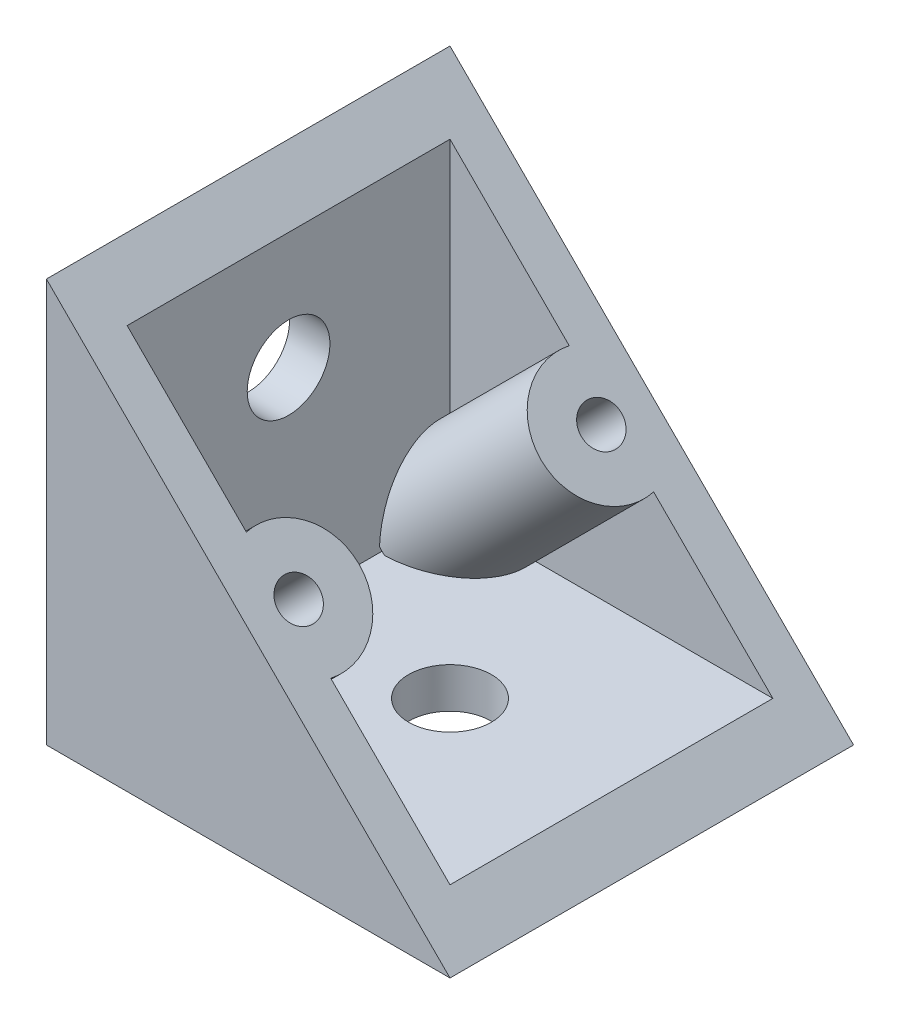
ISO-10303-21;
HEADER;
FILE_DESCRIPTION(('STEP AP214'),'2;1');
FILE_NAME('part.step','',(''),(''),'','','');
FILE_SCHEMA(('AUTOMOTIVE_DESIGN { 1 0 10303 214 1 1 1 1 }'));
ENDSEC;
DATA;
#1=APPLICATION_CONTEXT('core data for automotive mechanical design processes');
#2=APPLICATION_PROTOCOL_DEFINITION('international standard','automotive_design',2000,#1);
#3=PRODUCT_CONTEXT('',#1,'mechanical');
#4=PRODUCT('Part','Part','',(#3));
#5=PRODUCT_RELATED_PRODUCT_CATEGORY('part','',(#4));
#6=PRODUCT_DEFINITION_FORMATION('','',#4);
#7=PRODUCT_DEFINITION_CONTEXT('part definition',#1,'design');
#8=PRODUCT_DEFINITION('design','',#6,#7);
#9=PRODUCT_DEFINITION_SHAPE('','',#8);
#10=(LENGTH_UNIT() NAMED_UNIT(*) SI_UNIT(.MILLI.,.METRE.));
#11=(NAMED_UNIT(*) PLANE_ANGLE_UNIT() SI_UNIT($,.RADIAN.));
#12=(NAMED_UNIT(*) SI_UNIT($,.STERADIAN.) SOLID_ANGLE_UNIT());
#13=UNCERTAINTY_MEASURE_WITH_UNIT(LENGTH_MEASURE(1.E-05),#10,'distance_accuracy_value','');
#14=(GEOMETRIC_REPRESENTATION_CONTEXT(3) GLOBAL_UNCERTAINTY_ASSIGNED_CONTEXT((#13)) GLOBAL_UNIT_ASSIGNED_CONTEXT((#10,
#11,#12)) REPRESENTATION_CONTEXT('',''));
#15=CARTESIAN_POINT('',(0.,0.,0.));
#16=DIRECTION('',(0.,0.,1.));
#17=DIRECTION('',(1.,0.,0.));
#18=AXIS2_PLACEMENT_3D('',#15,#16,#17);
#19=CARTESIAN_POINT('',(0.,0.,40.));
#20=DIRECTION('',(0.,1.,0.));
#21=DIRECTION('',(0.,0.,1.));
#22=AXIS2_PLACEMENT_3D('',#19,#20,#21);
#23=PLANE('',#22);
#24=DIRECTION('',(-1.,0.,0.));
#25=VECTOR('',#24,1.);
#26=CARTESIAN_POINT('',(11.,0.,24.));
#27=LINE('',#26,#25);
#28=CARTESIAN_POINT('',(11.,0.,24.));
#29=VERTEX_POINT('',#28);
#30=CARTESIAN_POINT('',(9.,0.,24.));
#31=VERTEX_POINT('',#30);
#32=EDGE_CURVE('E244',#29,#31,#27,.T.);
#33=ORIENTED_EDGE('',*,*,#32,.F.);
#34=DIRECTION('',(0.,0.,1.));
#35=VECTOR('',#34,1.);
#36=CARTESIAN_POINT('',(11.,0.,16.));
#37=LINE('',#36,#35);
#38=CARTESIAN_POINT('',(11.,0.,16.));
#39=VERTEX_POINT('',#38);
#40=EDGE_CURVE('E257',#39,#29,#37,.T.);
#41=ORIENTED_EDGE('',*,*,#40,.F.);
#42=DIRECTION('',(1.,0.,0.));
#43=VECTOR('',#42,1.);
#44=CARTESIAN_POINT('',(9.,0.,16.));
#45=LINE('',#44,#43);
#46=CARTESIAN_POINT('',(9.,0.,16.));
#47=VERTEX_POINT('',#46);
#48=EDGE_CURVE('E266',#47,#39,#45,.T.);
#49=ORIENTED_EDGE('',*,*,#48,.F.);
#50=DIRECTION('',(0.,0.,-1.));
#51=VECTOR('',#50,1.);
#52=CARTESIAN_POINT('',(9.,0.,24.));
#53=LINE('',#52,#51);
#54=EDGE_CURVE('E247',#31,#47,#53,.T.);
#55=ORIENTED_EDGE('',*,*,#54,.F.);
#56=EDGE_LOOP('',(#33,#41,#49,#55));
#57=FACE_BOUND('',#56,.T.);
#58=CARTESIAN_POINT('',(20.,0.,20.));
#59=DIRECTION('',(0.,-1.,0.));
#60=DIRECTION('',(0.,0.,-1.));
#61=AXIS2_PLACEMENT_3D('',#58,#59,#60);
#62=CIRCLE('',#61,4.1);
#63=CARTESIAN_POINT('',(20.,0.,15.9));
#64=VERTEX_POINT('',#63);
#65=EDGE_CURVE('E348',#64,#64,#62,.T.);
#66=ORIENTED_EDGE('',*,*,#65,.F.);
#67=EDGE_LOOP('',(#66));
#68=FACE_BOUND('',#67,.T.);
#69=DIRECTION('',(1.,0.,0.));
#70=VECTOR('',#69,1.);
#71=CARTESIAN_POINT('',(0.,0.,0.));
#72=LINE('',#71,#70);
#73=CARTESIAN_POINT('',(0.,0.,0.));
#74=VERTEX_POINT('',#73);
#75=CARTESIAN_POINT('',(40.,0.,0.));
#76=VERTEX_POINT('',#75);
#77=EDGE_CURVE('E505',#74,#76,#72,.T.);
#78=ORIENTED_EDGE('',*,*,#77,.T.);
#79=DIRECTION('',(0.,0.,-1.));
#80=VECTOR('',#79,1.);
#81=CARTESIAN_POINT('',(40.,0.,40.));
#82=LINE('',#81,#80);
#83=CARTESIAN_POINT('',(40.,0.,40.));
#84=VERTEX_POINT('',#83);
#85=EDGE_CURVE('E39',#84,#76,#82,.T.);
#86=ORIENTED_EDGE('',*,*,#85,.F.);
#87=DIRECTION('',(1.,0.,0.));
#88=VECTOR('',#87,1.);
#89=CARTESIAN_POINT('',(0.,0.,40.));
#90=LINE('',#89,#88);
#91=CARTESIAN_POINT('',(0.,0.,40.));
#92=VERTEX_POINT('',#91);
#93=EDGE_CURVE('E640',#92,#84,#90,.T.);
#94=ORIENTED_EDGE('',*,*,#93,.F.);
#95=DIRECTION('',(0.,0.,-1.));
#96=VECTOR('',#95,1.);
#97=CARTESIAN_POINT('',(0.,0.,40.));
#98=LINE('',#97,#96);
#99=EDGE_CURVE('E11',#92,#74,#98,.T.);
#100=ORIENTED_EDGE('',*,*,#99,.T.);
#101=EDGE_LOOP('',(#78,#86,#94,#100));
#102=FACE_BOUND('',#101,.T.);
#103=DIRECTION('',(-1.,0.,0.));
#104=VECTOR('',#103,1.);
#105=CARTESIAN_POINT('',(31.,0.,24.));
#106=LINE('',#105,#104);
#107=CARTESIAN_POINT('',(31.,0.,24.));
#108=VERTEX_POINT('',#107);
#109=CARTESIAN_POINT('',(29.,0.,24.));
#110=VERTEX_POINT('',#109);
#111=EDGE_CURVE('E243',#108,#110,#106,.T.);
#112=ORIENTED_EDGE('',*,*,#111,.F.);
#113=DIRECTION('',(0.,0.,1.));
#114=VECTOR('',#113,1.);
#115=CARTESIAN_POINT('',(31.,0.,24.));
#116=LINE('',#115,#114);
#117=CARTESIAN_POINT('',(31.,0.,16.));
#118=VERTEX_POINT('',#117);
#119=EDGE_CURVE('E240',#118,#108,#116,.T.);
#120=ORIENTED_EDGE('',*,*,#119,.F.);
#121=DIRECTION('',(1.,0.,0.));
#122=VECTOR('',#121,1.);
#123=CARTESIAN_POINT('',(31.,0.,16.));
#124=LINE('',#123,#122);
#125=CARTESIAN_POINT('',(29.,0.,16.));
#126=VERTEX_POINT('',#125);
#127=EDGE_CURVE('E52',#126,#118,#124,.T.);
#128=ORIENTED_EDGE('',*,*,#127,.F.);
#129=DIRECTION('',(0.,0.,-1.));
#130=VECTOR('',#129,1.);
#131=CARTESIAN_POINT('',(29.,0.,16.));
#132=LINE('',#131,#130);
#133=EDGE_CURVE('E47',#110,#126,#132,.T.);
#134=ORIENTED_EDGE('',*,*,#133,.F.);
#135=EDGE_LOOP('',(#112,#120,#128,#134));
#136=FACE_BOUND('',#135,.T.);
#137=ADVANCED_FACE('F30',(#57,#68,#102,#136),#23,.F.);
#138=CARTESIAN_POINT('',(0.,0.,40.));
#139=DIRECTION('',(1.,0.,0.));
#140=DIRECTION('',(0.,0.,-1.));
#141=AXIS2_PLACEMENT_3D('',#138,#139,#140);
#142=PLANE('',#141);
#143=DIRECTION('',(0.,-1.,0.));
#144=VECTOR('',#143,1.);
#145=CARTESIAN_POINT('',(0.,29.,16.));
#146=LINE('',#145,#144);
#147=CARTESIAN_POINT('',(0.,31.,16.));
#148=VERTEX_POINT('',#147);
#149=CARTESIAN_POINT('',(0.,29.,16.));
#150=VERTEX_POINT('',#149);
#151=EDGE_CURVE('E315',#148,#150,#146,.T.);
#152=ORIENTED_EDGE('',*,*,#151,.F.);
#153=DIRECTION('',(0.,0.,-1.));
#154=VECTOR('',#153,1.);
#155=CARTESIAN_POINT('',(0.,31.,16.));
#156=LINE('',#155,#154);
#157=CARTESIAN_POINT('',(0.,31.,24.));
#158=VERTEX_POINT('',#157);
#159=EDGE_CURVE('E320',#158,#148,#156,.T.);
#160=ORIENTED_EDGE('',*,*,#159,.F.);
#161=DIRECTION('',(0.,1.,0.));
#162=VECTOR('',#161,1.);
#163=CARTESIAN_POINT('',(0.,31.,24.));
#164=LINE('',#163,#162);
#165=CARTESIAN_POINT('',(0.,29.,24.));
#166=VERTEX_POINT('',#165);
#167=EDGE_CURVE('E332',#166,#158,#164,.T.);
#168=ORIENTED_EDGE('',*,*,#167,.F.);
#169=DIRECTION('',(0.,0.,1.));
#170=VECTOR('',#169,1.);
#171=CARTESIAN_POINT('',(0.,29.,16.));
#172=LINE('',#171,#170);
#173=EDGE_CURVE('E329',#150,#166,#172,.T.);
#174=ORIENTED_EDGE('',*,*,#173,.F.);
#175=EDGE_LOOP('',(#152,#160,#168,#174));
#176=FACE_BOUND('',#175,.T.);
#177=CARTESIAN_POINT('',(0.,24.3981340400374,19.9999999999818));
#178=DIRECTION('',(-1.,0.,0.));
#179=DIRECTION('',(0.,0.,1.));
#180=AXIS2_PLACEMENT_3D('',#177,#178,#179);
#181=CIRCLE('',#180,4.1);
#182=CARTESIAN_POINT('',(0.,24.3981340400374,24.0999999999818));
#183=VERTEX_POINT('',#182);
#184=EDGE_CURVE('E351',#183,#183,#181,.T.);
#185=ORIENTED_EDGE('',*,*,#184,.F.);
#186=EDGE_LOOP('',(#185));
#187=FACE_BOUND('',#186,.T.);
#188=DIRECTION('',(0.,-1.,0.));
#189=VECTOR('',#188,1.);
#190=CARTESIAN_POINT('',(0.,0.,0.));
#191=LINE('',#190,#189);
#192=CARTESIAN_POINT('',(0.,40.,0.));
#193=VERTEX_POINT('',#192);
#194=EDGE_CURVE('E612',#193,#74,#191,.T.);
#195=ORIENTED_EDGE('',*,*,#194,.T.);
#196=ORIENTED_EDGE('',*,*,#99,.F.);
#197=DIRECTION('',(0.,-1.,0.));
#198=VECTOR('',#197,1.);
#199=CARTESIAN_POINT('',(0.,0.,40.));
#200=LINE('',#199,#198);
#201=CARTESIAN_POINT('',(0.,40.,40.));
#202=VERTEX_POINT('',#201);
#203=EDGE_CURVE('E636',#202,#92,#200,.T.);
#204=ORIENTED_EDGE('',*,*,#203,.F.);
#205=DIRECTION('',(0.,0.,-1.));
#206=VECTOR('',#205,1.);
#207=CARTESIAN_POINT('',(0.,40.,40.));
#208=LINE('',#207,#206);
#209=EDGE_CURVE('E622',#202,#193,#208,.T.);
#210=ORIENTED_EDGE('',*,*,#209,.T.);
#211=EDGE_LOOP('',(#195,#196,#204,#210));
#212=FACE_BOUND('',#211,.T.);
#213=DIRECTION('',(0.,-1.,0.));
#214=VECTOR('',#213,1.);
#215=CARTESIAN_POINT('',(0.,9.,16.));
#216=LINE('',#215,#214);
#217=CARTESIAN_POINT('',(0.,11.,16.));
#218=VERTEX_POINT('',#217);
#219=CARTESIAN_POINT('',(0.,9.,16.));
#220=VERTEX_POINT('',#219);
#221=EDGE_CURVE('E282',#218,#220,#216,.T.);
#222=ORIENTED_EDGE('',*,*,#221,.F.);
#223=DIRECTION('',(0.,0.,-1.));
#224=VECTOR('',#223,1.);
#225=CARTESIAN_POINT('',(0.,11.,16.));
#226=LINE('',#225,#224);
#227=CARTESIAN_POINT('',(0.,11.,24.));
#228=VERTEX_POINT('',#227);
#229=EDGE_CURVE('E287',#228,#218,#226,.T.);
#230=ORIENTED_EDGE('',*,*,#229,.F.);
#231=DIRECTION('',(0.,1.,0.));
#232=VECTOR('',#231,1.);
#233=CARTESIAN_POINT('',(0.,11.,24.));
#234=LINE('',#233,#232);
#235=CARTESIAN_POINT('',(0.,9.,24.));
#236=VERTEX_POINT('',#235);
#237=EDGE_CURVE('E299',#236,#228,#234,.T.);
#238=ORIENTED_EDGE('',*,*,#237,.F.);
#239=DIRECTION('',(0.,0.,1.));
#240=VECTOR('',#239,1.);
#241=CARTESIAN_POINT('',(0.,9.,24.));
#242=LINE('',#241,#240);
#243=EDGE_CURVE('E296',#220,#236,#242,.T.);
#244=ORIENTED_EDGE('',*,*,#243,.F.);
#245=EDGE_LOOP('',(#222,#230,#238,#244));
#246=FACE_BOUND('',#245,.T.);
#247=ADVANCED_FACE('F32',(#176,#187,#212,#246),#142,.F.);
#248=CARTESIAN_POINT('',(0.,40.,40.));
#249=DIRECTION('',(-0.707106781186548,-0.707106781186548,0.));
#250=DIRECTION('',(0.707106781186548,-0.707106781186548,0.));
#251=AXIS2_PLACEMENT_3D('',#248,#249,#250);
#252=PLANE('',#251);
#253=DIRECTION('',(-0.707106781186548,0.707106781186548,0.));
#254=VECTOR('',#253,1.);
#255=CARTESIAN_POINT('',(0.,40.,0.));
#256=LINE('',#255,#254);
#257=EDGE_CURVE('E626',#76,#193,#256,.T.);
#258=ORIENTED_EDGE('',*,*,#257,.T.);
#259=ORIENTED_EDGE('',*,*,#209,.F.);
#260=DIRECTION('',(-0.707106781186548,0.707106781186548,0.));
#261=VECTOR('',#260,1.);
#262=CARTESIAN_POINT('',(0.,40.,40.));
#263=LINE('',#262,#261);
#264=EDGE_CURVE('E632',#84,#202,#263,.T.);
#265=ORIENTED_EDGE('',*,*,#264,.F.);
#266=ORIENTED_EDGE('',*,*,#85,.T.);
#267=EDGE_LOOP('',(#258,#259,#265,#266));
#268=FACE_BOUND('',#267,.T.);
#269=CARTESIAN_POINT('',(20.,20.,5.));
#270=DIRECTION('',(0.707106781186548,0.707106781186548,0.));
#271=DIRECTION('',(-0.707106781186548,0.707106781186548,0.));
#272=AXIS2_PLACEMENT_3D('',#269,#270,#271);
#273=CIRCLE('',#272,2.);
#274=CARTESIAN_POINT('',(18.5857864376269,21.4142135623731,5.));
#275=VERTEX_POINT('',#274);
#276=EDGE_CURVE('E624',#275,#275,#273,.T.);
#277=ORIENTED_EDGE('',*,*,#276,.F.);
#278=EDGE_LOOP('',(#277));
#279=FACE_BOUND('',#278,.T.);
#280=CARTESIAN_POINT('',(20.,20.,35.));
#281=DIRECTION('',(0.707106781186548,0.707106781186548,0.));
#282=DIRECTION('',(-0.707106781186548,0.707106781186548,0.));
#283=AXIS2_PLACEMENT_3D('',#280,#281,#282);
#284=CIRCLE('',#283,2.);
#285=CARTESIAN_POINT('',(18.5857864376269,21.4142135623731,35.));
#286=VERTEX_POINT('',#285);
#287=EDGE_CURVE('E645',#286,#286,#284,.T.);
#288=ORIENTED_EDGE('',*,*,#287,.F.);
#289=EDGE_LOOP('',(#288));
#290=FACE_BOUND('',#289,.T.);
#291=DIRECTION('',(-0.707106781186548,0.707106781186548,0.));
#292=VECTOR('',#291,1.);
#293=CARTESIAN_POINT('',(20.,20.,4.));
#294=LINE('',#293,#292);
#295=CARTESIAN_POINT('',(15.8166998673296,24.1833001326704,4.));
#296=VERTEX_POINT('',#295);
#297=CARTESIAN_POINT('',(4.,36.,4.));
#298=VERTEX_POINT('',#297);
#299=EDGE_CURVE('E369',#296,#298,#294,.T.);
#300=ORIENTED_EDGE('',*,*,#299,.F.);
#301=CARTESIAN_POINT('',(20.,20.,5.));
#302=DIRECTION('',(-0.707106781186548,-0.707106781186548,0.));
#303=DIRECTION('',(0.707106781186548,-0.707106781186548,0.));
#304=AXIS2_PLACEMENT_3D('',#301,#302,#303);
#305=CIRCLE('',#304,6.);
#306=CARTESIAN_POINT('',(24.1833001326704,15.8166998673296,4.));
#307=VERTEX_POINT('',#306);
#308=EDGE_CURVE('E359',#296,#307,#305,.F.);
#309=ORIENTED_EDGE('',*,*,#308,.T.);
#310=CARTESIAN_POINT('',(36.,4.,4.));
#311=VERTEX_POINT('',#310);
#312=EDGE_CURVE('E372',#311,#307,#294,.T.);
#313=ORIENTED_EDGE('',*,*,#312,.F.);
#314=DIRECTION('',(0.,0.,-1.));
#315=VECTOR('',#314,1.);
#316=CARTESIAN_POINT('',(36.,4.,40.));
#317=LINE('',#316,#315);
#318=CARTESIAN_POINT('',(36.,4.,36.));
#319=VERTEX_POINT('',#318);
#320=EDGE_CURVE('E364',#319,#311,#317,.T.);
#321=ORIENTED_EDGE('',*,*,#320,.F.);
#322=DIRECTION('',(-0.707106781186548,0.707106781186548,0.));
#323=VECTOR('',#322,1.);
#324=CARTESIAN_POINT('',(20.,20.,36.));
#325=LINE('',#324,#323);
#326=CARTESIAN_POINT('',(24.1833001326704,15.8166998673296,36.));
#327=VERTEX_POINT('',#326);
#328=EDGE_CURVE('E379',#319,#327,#325,.T.);
#329=ORIENTED_EDGE('',*,*,#328,.T.);
#330=CARTESIAN_POINT('',(20.,20.,35.));
#331=DIRECTION('',(-0.707106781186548,-0.707106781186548,0.));
#332=DIRECTION('',(0.707106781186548,-0.707106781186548,0.));
#333=AXIS2_PLACEMENT_3D('',#330,#331,#332);
#334=CIRCLE('',#333,6.);
#335=CARTESIAN_POINT('',(15.8166998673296,24.1833001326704,36.));
#336=VERTEX_POINT('',#335);
#337=EDGE_CURVE('E386',#327,#336,#334,.F.);
#338=ORIENTED_EDGE('',*,*,#337,.T.);
#339=CARTESIAN_POINT('',(4.,36.,36.));
#340=VERTEX_POINT('',#339);
#341=EDGE_CURVE('E375',#336,#340,#325,.T.);
#342=ORIENTED_EDGE('',*,*,#341,.T.);
#343=DIRECTION('',(0.,0.,-1.));
#344=VECTOR('',#343,1.);
#345=CARTESIAN_POINT('',(4.,36.,40.));
#346=LINE('',#345,#344);
#347=EDGE_CURVE('E376',#340,#298,#346,.T.);
#348=ORIENTED_EDGE('',*,*,#347,.T.);
#349=EDGE_LOOP('',(#300,#309,#313,#321,#329,#338,#342,#348));
#350=FACE_BOUND('',#349,.T.);
#351=ADVANCED_FACE('F488',(#268,#279,#290,#350),#252,.F.);
#352=CARTESIAN_POINT('',(0.,0.,40.));
#353=DIRECTION('',(0.,0.,-1.));
#354=DIRECTION('',(-1.,0.,0.));
#355=AXIS2_PLACEMENT_3D('',#352,#353,#354);
#356=PLANE('',#355);
#357=ORIENTED_EDGE('',*,*,#203,.T.);
#358=ORIENTED_EDGE('',*,*,#93,.T.);
#359=ORIENTED_EDGE('',*,*,#264,.T.);
#360=EDGE_LOOP('',(#357,#358,#359));
#361=FACE_BOUND('',#360,.T.);
#362=ADVANCED_FACE('F485',(#361),#356,.F.);
#363=CARTESIAN_POINT('',(0.,0.,0.));
#364=DIRECTION('',(0.,0.,-1.));
#365=DIRECTION('',(-1.,0.,0.));
#366=AXIS2_PLACEMENT_3D('',#363,#364,#365);
#367=PLANE('',#366);
#368=ORIENTED_EDGE('',*,*,#194,.F.);
#369=ORIENTED_EDGE('',*,*,#257,.F.);
#370=ORIENTED_EDGE('',*,*,#77,.F.);
#371=EDGE_LOOP('',(#368,#369,#370));
#372=FACE_BOUND('',#371,.T.);
#373=ADVANCED_FACE('F483',(#372),#367,.T.);
#374=CARTESIAN_POINT('',(20.,20.,5.));
#375=DIRECTION('',(0.707106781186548,0.707106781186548,0.));
#376=DIRECTION('',(-0.707106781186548,0.707106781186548,0.));
#377=AXIS2_PLACEMENT_3D('',#374,#375,#376);
#378=CYLINDRICAL_SURFACE('',#377,2.);
#379=CARTESIAN_POINT('',(5.85786437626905,5.85786437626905,5.));
#380=DIRECTION('',(0.707106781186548,0.707106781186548,0.));
#381=DIRECTION('',(-0.707106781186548,0.707106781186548,0.));
#382=AXIS2_PLACEMENT_3D('',#379,#380,#381);
#383=CIRCLE('',#382,2.);
#384=CARTESIAN_POINT('',(4.44365081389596,7.27207793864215,5.));
#385=VERTEX_POINT('',#384);
#386=EDGE_CURVE('E629',#385,#385,#383,.T.);
#387=ORIENTED_EDGE('',*,*,#386,.F.);
#388=EDGE_LOOP('',(#387));
#389=FACE_BOUND('',#388,.T.);
#390=ORIENTED_EDGE('',*,*,#276,.T.);
#391=EDGE_LOOP('',(#390));
#392=FACE_BOUND('',#391,.T.);
#393=ADVANCED_FACE('F479',(#389,#392),#378,.F.);
#394=CARTESIAN_POINT('',(5.85786437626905,5.85786437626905,5.));
#395=DIRECTION('',(0.707106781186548,0.707106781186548,0.));
#396=DIRECTION('',(-0.707106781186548,0.707106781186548,0.));
#397=AXIS2_PLACEMENT_3D('',#394,#395,#396);
#398=CONICAL_SURFACE('',#397,2.,1.02974425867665);
#399=CARTESIAN_POINT('',(5.00811913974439,5.00811913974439,4.99999999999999));
#400=VERTEX_POINT('',#399);
#401=VERTEX_LOOP('',#400);
#402=FACE_BOUND('',#401,.T.);
#403=ORIENTED_EDGE('',*,*,#386,.T.);
#404=EDGE_LOOP('',(#403));
#405=FACE_BOUND('',#404,.T.);
#406=ADVANCED_FACE('F475',(#402,#405),#398,.F.);
#407=CARTESIAN_POINT('',(20.,20.,35.));
#408=DIRECTION('',(0.707106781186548,0.707106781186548,0.));
#409=DIRECTION('',(-0.707106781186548,0.707106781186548,0.));
#410=AXIS2_PLACEMENT_3D('',#407,#408,#409);
#411=CYLINDRICAL_SURFACE('',#410,2.);
#412=CARTESIAN_POINT('',(5.85786437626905,5.85786437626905,35.));
#413=DIRECTION('',(0.707106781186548,0.707106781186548,0.));
#414=DIRECTION('',(-0.707106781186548,0.707106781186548,0.));
#415=AXIS2_PLACEMENT_3D('',#412,#413,#414);
#416=CIRCLE('',#415,2.);
#417=CARTESIAN_POINT('',(4.44365081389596,7.27207793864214,35.));
#418=VERTEX_POINT('',#417);
#419=EDGE_CURVE('E460',#418,#418,#416,.T.);
#420=ORIENTED_EDGE('',*,*,#419,.F.);
#421=EDGE_LOOP('',(#420));
#422=FACE_BOUND('',#421,.T.);
#423=ORIENTED_EDGE('',*,*,#287,.T.);
#424=EDGE_LOOP('',(#423));
#425=FACE_BOUND('',#424,.T.);
#426=ADVANCED_FACE('F471',(#422,#425),#411,.F.);
#427=CARTESIAN_POINT('',(5.85786437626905,5.85786437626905,35.));
#428=DIRECTION('',(0.707106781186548,0.707106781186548,0.));
#429=DIRECTION('',(-0.707106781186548,0.707106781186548,0.));
#430=AXIS2_PLACEMENT_3D('',#427,#428,#429);
#431=CONICAL_SURFACE('',#430,1.99999999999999,1.02974425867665);
#432=CARTESIAN_POINT('',(5.00811913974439,5.00811913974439,35.));
#433=VERTEX_POINT('',#432);
#434=VERTEX_LOOP('',#433);
#435=FACE_BOUND('',#434,.T.);
#436=ORIENTED_EDGE('',*,*,#419,.T.);
#437=EDGE_LOOP('',(#436));
#438=FACE_BOUND('',#437,.T.);
#439=ADVANCED_FACE('F450',(#435,#438),#431,.F.);
#440=CARTESIAN_POINT('',(0.,4.,40.));
#441=DIRECTION('',(0.,1.,0.));
#442=DIRECTION('',(0.,0.,1.));
#443=AXIS2_PLACEMENT_3D('',#440,#441,#442);
#444=PLANE('',#443);
#445=CARTESIAN_POINT('',(20.,4.,20.));
#446=DIRECTION('',(0.,1.,0.));
#447=DIRECTION('',(0.,0.,1.));
#448=AXIS2_PLACEMENT_3D('',#445,#446,#447);
#449=CIRCLE('',#448,4.09999999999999);
#450=CARTESIAN_POINT('',(20.,4.,24.1));
#451=VERTEX_POINT('',#450);
#452=EDGE_CURVE('E34',#451,#451,#449,.T.);
#453=ORIENTED_EDGE('',*,*,#452,.F.);
#454=EDGE_LOOP('',(#453));
#455=FACE_BOUND('',#454,.T.);
#456=DIRECTION('',(0.,0.,-1.));
#457=VECTOR('',#456,1.);
#458=CARTESIAN_POINT('',(4.,4.,40.));
#459=LINE('',#458,#457);
#460=CARTESIAN_POINT('',(4.,4.,29.6063400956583));
#461=VERTEX_POINT('',#460);
#462=CARTESIAN_POINT('',(4.,4.,10.3936599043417));
#463=VERTEX_POINT('',#462);
#464=EDGE_CURVE('E360',#461,#463,#459,.T.);
#465=ORIENTED_EDGE('',*,*,#464,.F.);
#466=CARTESIAN_POINT('',(8.68319237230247,4.,24.6100151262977));
#467=CARTESIAN_POINT('',(8.49947597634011,4.,24.7955344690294));
#468=CARTESIAN_POINT('',(8.31608113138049,4.,24.9813726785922));
#469=CARTESIAN_POINT('',(7.95005978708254,4.,25.353809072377));
#470=CARTESIAN_POINT('',(7.76743329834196,4.,25.540407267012));
#471=CARTESIAN_POINT('',(7.22074261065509,4.,26.1016809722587));
#472=CARTESIAN_POINT('',(6.85802795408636,4.,26.4776736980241));
#473=CARTESIAN_POINT('',(6.13600999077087,4.,27.2363602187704));
#474=CARTESIAN_POINT('',(5.77673110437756,4.,27.6190773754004));
#475=CARTESIAN_POINT('',(5.24378133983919,4.,28.1985808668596));
#476=CARTESIAN_POINT('',(5.06714226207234,4.,28.3926351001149));
#477=CARTESIAN_POINT('',(4.71638736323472,4.,28.7830071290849));
#478=CARTESIAN_POINT('',(4.54227148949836,4.,28.9793248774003));
#479=CARTESIAN_POINT('',(4.17843137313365,4.,29.3963740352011));
#480=CARTESIAN_POINT('',(3.98907849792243,4.,29.6174307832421));
#481=CARTESIAN_POINT('',(3.61572465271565,4.,30.0641095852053));
#482=CARTESIAN_POINT('',(3.43172478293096,4.,30.2897325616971));
#483=CARTESIAN_POINT('',(3.07097596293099,4.,30.7473202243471));
#484=CARTESIAN_POINT('',(2.89423829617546,4.,30.9792939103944));
#485=CARTESIAN_POINT('',(2.63748554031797,4.,31.333268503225));
#486=CARTESIAN_POINT('',(2.55330458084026,4.,31.452245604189));
#487=CARTESIAN_POINT('',(2.38837609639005,4.,31.6925502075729));
#488=CARTESIAN_POINT('',(2.30762826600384,4.,31.8138774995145));
#489=CARTESIAN_POINT('',(2.14469482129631,4.,32.0681191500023));
#490=CARTESIAN_POINT('',(2.06282606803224,4.,32.2012377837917));
#491=CARTESIAN_POINT('',(1.9052783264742,4.,32.4711354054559));
#492=CARTESIAN_POINT('',(1.829599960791,4.,32.6079147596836));
#493=CARTESIAN_POINT('',(1.6866881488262,4.,32.8846585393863));
#494=CARTESIAN_POINT('',(1.61940005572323,4.,33.0245944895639));
#495=CARTESIAN_POINT('',(1.49488139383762,4.,33.3089056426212));
#496=CARTESIAN_POINT('',(1.43764831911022,4.,33.4532797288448));
#497=CARTESIAN_POINT('',(1.34868670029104,4.,33.7096597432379));
#498=CARTESIAN_POINT('',(1.31416252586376,4.,33.8206910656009));
#499=CARTESIAN_POINT('',(1.25347517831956,4.,34.0449760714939));
#500=CARTESIAN_POINT('',(1.22730744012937,4.,34.1582285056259));
#501=CARTESIAN_POINT('',(1.18410700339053,4.,34.3883195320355));
#502=CARTESIAN_POINT('',(1.16722176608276,4.,34.5051864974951));
#503=CARTESIAN_POINT('',(1.14985730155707,4.,34.6813651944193));
#504=CARTESIAN_POINT('',(1.14539586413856,4.,34.7403039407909));
#505=CARTESIAN_POINT('',(1.13919111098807,4.,34.8583338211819));
#506=CARTESIAN_POINT('',(1.13744824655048,4.,34.9174249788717));
#507=CARTESIAN_POINT('',(1.13708914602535,4.,34.9765336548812));
#508=B_SPLINE_CURVE_WITH_KNOTS('',3,(#466,#467,#468,#469,#470,#471,#472,#473,#474,#475,#476,
#477,#478,#479,#480,#481,#482,#483,#484,#485,#486,#487,#488,#489,#490,#491,#492,#493,#494,#495,
#496,#497,#498,#499,#500,#501,#502,#503,#504,#505,#506,#507),.UNSPECIFIED.,.F.,.F.,(4,2,2,2,2,2,
2,2,2,2,2,2,2,2,2,2,2,2,2,2,4),(0.,0.783276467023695,1.56656370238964,3.13382263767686,
4.70853352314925,5.49574316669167,6.28293635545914,7.15607461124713,8.02939107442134,
8.90401673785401,9.34120934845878,9.77836298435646,10.2470681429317,10.7158203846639,
11.1813395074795,11.6467424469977,11.9952909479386,12.3436487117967,12.6973913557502,
12.8746580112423,13.0519540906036),.UNSPECIFIED.);
#509=CARTESIAN_POINT('',(4.51523460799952,4.,29.011071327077));
#510=VERTEX_POINT('',#509);
#511=EDGE_CURVE('E454',#461,#510,#508,.F.);
#512=ORIENTED_EDGE('',*,*,#511,.T.);
#513=CARTESIAN_POINT('',(4.,4.,35.));
#514=DIRECTION('',(0.,1.,0.));
#515=DIRECTION('',(1.,0.,0.));
#516=AXIS2_PLACEMENT_3D('',#513,#514,#515);
#517=ELLIPSE('',#516,8.48528137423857,6.);
#518=CARTESIAN_POINT('',(12.3666002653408,4.,36.));
#519=VERTEX_POINT('',#518);
#520=EDGE_CURVE('E418',#519,#510,#517,.T.);
#521=ORIENTED_EDGE('',*,*,#520,.F.);
#522=DIRECTION('',(1.,0.,0.));
#523=VECTOR('',#522,1.);
#524=CARTESIAN_POINT('',(0.,4.,36.));
#525=LINE('',#524,#523);
#526=EDGE_CURVE('E368',#519,#319,#525,.T.);
#527=ORIENTED_EDGE('',*,*,#526,.T.);
#528=ORIENTED_EDGE('',*,*,#320,.T.);
#529=DIRECTION('',(1.,0.,0.));
#530=VECTOR('',#529,1.);
#531=CARTESIAN_POINT('',(0.,4.,4.));
#532=LINE('',#531,#530);
#533=CARTESIAN_POINT('',(12.3666002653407,4.,4.));
#534=VERTEX_POINT('',#533);
#535=EDGE_CURVE('E358',#534,#311,#532,.T.);
#536=ORIENTED_EDGE('',*,*,#535,.F.);
#537=CARTESIAN_POINT('',(4.,4.,5.));
#538=DIRECTION('',(0.,1.,0.));
#539=DIRECTION('',(1.,0.,0.));
#540=AXIS2_PLACEMENT_3D('',#537,#538,#539);
#541=ELLIPSE('',#540,8.48528137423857,6.);
#542=CARTESIAN_POINT('',(4.51523460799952,4.,10.988928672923));
#543=VERTEX_POINT('',#542);
#544=EDGE_CURVE('E405',#534,#543,#541,.F.);
#545=ORIENTED_EDGE('',*,*,#544,.T.);
#546=CARTESIAN_POINT('',(8.68319237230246,4.,15.3899848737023));
#547=CARTESIAN_POINT('',(8.4994759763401,4.,15.2044655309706));
#548=CARTESIAN_POINT('',(8.31608113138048,4.,15.0186273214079));
#549=CARTESIAN_POINT('',(7.95005978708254,4.,14.646190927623));
#550=CARTESIAN_POINT('',(7.76743329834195,4.,14.459592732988));
#551=CARTESIAN_POINT('',(7.22074261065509,4.,13.8983190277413));
#552=CARTESIAN_POINT('',(6.85802795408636,4.,13.5223263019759));
#553=CARTESIAN_POINT('',(6.13600999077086,4.,12.7636397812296));
#554=CARTESIAN_POINT('',(5.77673110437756,4.,12.3809226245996));
#555=CARTESIAN_POINT('',(5.24378133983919,4.,11.8014191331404));
#556=CARTESIAN_POINT('',(5.06714226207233,4.,11.6073648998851));
#557=CARTESIAN_POINT('',(4.71638736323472,4.,11.2169928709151));
#558=CARTESIAN_POINT('',(4.54227148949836,4.,11.0206751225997));
#559=CARTESIAN_POINT('',(4.17843137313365,4.,10.6036259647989));
#560=CARTESIAN_POINT('',(3.98907849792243,4.,10.3825692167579));
#561=CARTESIAN_POINT('',(3.61572465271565,4.,9.93589041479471));
#562=CARTESIAN_POINT('',(3.43172478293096,4.,9.71026743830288));
#563=CARTESIAN_POINT('',(3.07097596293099,4.,9.25267977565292));
#564=CARTESIAN_POINT('',(2.89423829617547,4.,9.02070608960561));
#565=CARTESIAN_POINT('',(2.63748554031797,4.,8.66673149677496));
#566=CARTESIAN_POINT('',(2.55330458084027,4.,8.54775439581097));
#567=CARTESIAN_POINT('',(2.38837609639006,4.,8.30744979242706));
#568=CARTESIAN_POINT('',(2.30762826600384,4.,8.18612250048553));
#569=CARTESIAN_POINT('',(2.14469482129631,4.,7.93188084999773));
#570=CARTESIAN_POINT('',(2.06282606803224,4.,7.79876221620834));
#571=CARTESIAN_POINT('',(1.90527832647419,4.,7.52886459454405));
#572=CARTESIAN_POINT('',(1.829599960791,4.,7.39208524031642));
#573=CARTESIAN_POINT('',(1.68668814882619,4.,7.11534146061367));
#574=CARTESIAN_POINT('',(1.61940005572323,4.,6.97540551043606));
#575=CARTESIAN_POINT('',(1.49488139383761,4.,6.69109435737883));
#576=CARTESIAN_POINT('',(1.43764831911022,4.,6.54672027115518));
#577=CARTESIAN_POINT('',(1.34868670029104,4.,6.29034025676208));
#578=CARTESIAN_POINT('',(1.31416252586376,4.,6.17930893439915));
#579=CARTESIAN_POINT('',(1.25347517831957,4.,5.95502392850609));
#580=CARTESIAN_POINT('',(1.22730744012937,4.,5.84177149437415));
#581=CARTESIAN_POINT('',(1.18410700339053,4.,5.61168046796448));
#582=CARTESIAN_POINT('',(1.16722176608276,4.,5.49481350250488));
#583=CARTESIAN_POINT('',(1.14985730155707,4.,5.31863480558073));
#584=CARTESIAN_POINT('',(1.14539586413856,4.,5.25969605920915));
#585=CARTESIAN_POINT('',(1.13919111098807,4.,5.14166617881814));
#586=CARTESIAN_POINT('',(1.13744824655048,4.,5.08257502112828));
#587=CARTESIAN_POINT('',(1.13708914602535,4.,5.02346634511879));
#588=B_SPLINE_CURVE_WITH_KNOTS('',3,(#546,#547,#548,#549,#550,#551,#552,#553,#554,#555,#556,
#557,#558,#559,#560,#561,#562,#563,#564,#565,#566,#567,#568,#569,#570,#571,#572,#573,#574,#575,
#576,#577,#578,#579,#580,#581,#582,#583,#584,#585,#586,#587),.UNSPECIFIED.,.F.,.F.,(4,2,2,2,2,2,
2,2,2,2,2,2,2,2,2,2,2,2,2,2,4),(0.,0.783276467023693,1.56656370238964,3.13382263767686,
4.70853352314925,5.49574316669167,6.28293635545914,7.15607461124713,8.02939107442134,
8.90401673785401,9.34120934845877,9.77836298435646,10.2470681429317,10.7158203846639,
11.1813395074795,11.6467424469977,11.9952909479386,12.3436487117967,12.6973913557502,
12.8746580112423,13.0519540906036),.UNSPECIFIED.);
#589=EDGE_CURVE('E435',#463,#543,#588,.F.);
#590=ORIENTED_EDGE('',*,*,#589,.F.);
#591=EDGE_LOOP('',(#465,#512,#521,#527,#528,#536,#545,#590));
#592=FACE_BOUND('',#591,.T.);
#593=ADVANCED_FACE('F446',(#455,#592),#444,.T.);
#594=CARTESIAN_POINT('',(4.,0.,40.));
#595=DIRECTION('',(1.,0.,0.));
#596=DIRECTION('',(0.,0.,-1.));
#597=AXIS2_PLACEMENT_3D('',#594,#595,#596);
#598=PLANE('',#597);
#599=CARTESIAN_POINT('',(4.,24.3981340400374,19.9999999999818));
#600=DIRECTION('',(1.,0.,0.));
#601=DIRECTION('',(0.,0.,-1.));
#602=AXIS2_PLACEMENT_3D('',#599,#600,#601);
#603=CIRCLE('',#602,4.09999999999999);
#604=CARTESIAN_POINT('',(4.,24.3981340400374,15.8999999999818));
#605=VERTEX_POINT('',#604);
#606=EDGE_CURVE('E354',#605,#605,#603,.T.);
#607=ORIENTED_EDGE('',*,*,#606,.F.);
#608=EDGE_LOOP('',(#607));
#609=FACE_BOUND('',#608,.T.);
#610=CARTESIAN_POINT('',(4.,4.,35.));
#611=DIRECTION('',(1.,0.,0.));
#612=DIRECTION('',(0.,1.,0.));
#613=AXIS2_PLACEMENT_3D('',#610,#611,#612);
#614=ELLIPSE('',#613,8.48528137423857,6.);
#615=CARTESIAN_POINT('',(4.,4.51523460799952,29.011071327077));
#616=VERTEX_POINT('',#615);
#617=CARTESIAN_POINT('',(4.,12.3666002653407,36.));
#618=VERTEX_POINT('',#617);
#619=EDGE_CURVE('E408',#616,#618,#614,.T.);
#620=ORIENTED_EDGE('',*,*,#619,.F.);
#621=CARTESIAN_POINT('',(4.,8.68319237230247,24.6100151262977));
#622=CARTESIAN_POINT('',(4.,8.49947597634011,24.7955344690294));
#623=CARTESIAN_POINT('',(4.,8.31608113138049,24.9813726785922));
#624=CARTESIAN_POINT('',(4.,7.95005978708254,25.353809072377));
#625=CARTESIAN_POINT('',(4.,7.76743329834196,25.540407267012));
#626=CARTESIAN_POINT('',(4.,7.22074261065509,26.1016809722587));
#627=CARTESIAN_POINT('',(4.,6.85802795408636,26.4776736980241));
#628=CARTESIAN_POINT('',(4.,6.13600999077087,27.2363602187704));
#629=CARTESIAN_POINT('',(4.,5.77673110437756,27.6190773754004));
#630=CARTESIAN_POINT('',(4.,5.24378133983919,28.1985808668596));
#631=CARTESIAN_POINT('',(4.,5.06714226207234,28.3926351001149));
#632=CARTESIAN_POINT('',(4.,4.71638736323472,28.7830071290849));
#633=CARTESIAN_POINT('',(4.,4.54227148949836,28.9793248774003));
#634=CARTESIAN_POINT('',(4.,4.17843137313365,29.3963740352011));
#635=CARTESIAN_POINT('',(4.,3.98907849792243,29.6174307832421));
#636=CARTESIAN_POINT('',(4.,3.61572465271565,30.0641095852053));
#637=CARTESIAN_POINT('',(4.,3.43172478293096,30.2897325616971));
#638=CARTESIAN_POINT('',(4.,3.07097596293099,30.7473202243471));
#639=CARTESIAN_POINT('',(4.,2.89423829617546,30.9792939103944));
#640=CARTESIAN_POINT('',(4.,2.63748554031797,31.333268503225));
#641=CARTESIAN_POINT('',(4.,2.55330458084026,31.452245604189));
#642=CARTESIAN_POINT('',(4.,2.38837609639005,31.6925502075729));
#643=CARTESIAN_POINT('',(4.,2.30762826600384,31.8138774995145));
#644=CARTESIAN_POINT('',(4.,2.14469482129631,32.0681191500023));
#645=CARTESIAN_POINT('',(4.,2.06282606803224,32.2012377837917));
#646=CARTESIAN_POINT('',(4.,1.9052783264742,32.4711354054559));
#647=CARTESIAN_POINT('',(4.,1.829599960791,32.6079147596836));
#648=CARTESIAN_POINT('',(4.,1.6866881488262,32.8846585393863));
#649=CARTESIAN_POINT('',(4.,1.61940005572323,33.0245944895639));
#650=CARTESIAN_POINT('',(4.,1.49488139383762,33.3089056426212));
#651=CARTESIAN_POINT('',(4.,1.43764831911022,33.4532797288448));
#652=CARTESIAN_POINT('',(4.,1.34868670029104,33.7096597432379));
#653=CARTESIAN_POINT('',(4.,1.31416252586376,33.8206910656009));
#654=CARTESIAN_POINT('',(4.,1.25347517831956,34.0449760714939));
#655=CARTESIAN_POINT('',(4.,1.22730744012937,34.1582285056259));
#656=CARTESIAN_POINT('',(4.,1.18410700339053,34.3883195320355));
#657=CARTESIAN_POINT('',(4.,1.16722176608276,34.5051864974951));
#658=CARTESIAN_POINT('',(4.,1.14985730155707,34.6813651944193));
#659=CARTESIAN_POINT('',(4.,1.14539586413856,34.7403039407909));
#660=CARTESIAN_POINT('',(4.,1.13919111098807,34.8583338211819));
#661=CARTESIAN_POINT('',(4.,1.13744824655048,34.9174249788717));
#662=CARTESIAN_POINT('',(4.,1.13708914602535,34.9765336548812));
#663=B_SPLINE_CURVE_WITH_KNOTS('',3,(#621,#622,#623,#624,#625,#626,#627,#628,#629,#630,#631,
#632,#633,#634,#635,#636,#637,#638,#639,#640,#641,#642,#643,#644,#645,#646,#647,#648,#649,#650,
#651,#652,#653,#654,#655,#656,#657,#658,#659,#660,#661,#662),.UNSPECIFIED.,.F.,.F.,(4,2,2,2,2,2,
2,2,2,2,2,2,2,2,2,2,2,2,2,2,4),(0.,0.783276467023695,1.56656370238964,3.13382263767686,
4.70853352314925,5.49574316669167,6.28293635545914,7.15607461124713,8.02939107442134,
8.90401673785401,9.34120934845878,9.77836298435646,10.2470681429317,10.7158203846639,
11.1813395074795,11.6467424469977,11.9952909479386,12.3436487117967,12.6973913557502,
12.8746580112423,13.0519540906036),.UNSPECIFIED.);
#664=EDGE_CURVE('E441',#616,#461,#663,.T.);
#665=ORIENTED_EDGE('',*,*,#664,.T.);
#666=ORIENTED_EDGE('',*,*,#464,.T.);
#667=CARTESIAN_POINT('',(4.,8.68319237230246,15.3899848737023));
#668=CARTESIAN_POINT('',(4.,8.4994759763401,15.2044655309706));
#669=CARTESIAN_POINT('',(4.,8.31608113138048,15.0186273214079));
#670=CARTESIAN_POINT('',(4.,7.95005978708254,14.646190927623));
#671=CARTESIAN_POINT('',(4.,7.76743329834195,14.459592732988));
#672=CARTESIAN_POINT('',(4.,7.22074261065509,13.8983190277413));
#673=CARTESIAN_POINT('',(4.,6.85802795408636,13.5223263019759));
#674=CARTESIAN_POINT('',(4.,6.13600999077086,12.7636397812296));
#675=CARTESIAN_POINT('',(4.,5.77673110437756,12.3809226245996));
#676=CARTESIAN_POINT('',(4.,5.24378133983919,11.8014191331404));
#677=CARTESIAN_POINT('',(4.,5.06714226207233,11.6073648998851));
#678=CARTESIAN_POINT('',(4.,4.71638736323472,11.2169928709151));
#679=CARTESIAN_POINT('',(4.,4.54227148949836,11.0206751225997));
#680=CARTESIAN_POINT('',(4.,4.17843137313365,10.6036259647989));
#681=CARTESIAN_POINT('',(4.,3.98907849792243,10.3825692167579));
#682=CARTESIAN_POINT('',(4.,3.61572465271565,9.93589041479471));
#683=CARTESIAN_POINT('',(4.,3.43172478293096,9.71026743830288));
#684=CARTESIAN_POINT('',(4.,3.07097596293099,9.25267977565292));
#685=CARTESIAN_POINT('',(4.,2.89423829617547,9.02070608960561));
#686=CARTESIAN_POINT('',(4.,2.63748554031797,8.66673149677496));
#687=CARTESIAN_POINT('',(4.,2.55330458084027,8.54775439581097));
#688=CARTESIAN_POINT('',(4.,2.38837609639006,8.30744979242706));
#689=CARTESIAN_POINT('',(4.,2.30762826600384,8.18612250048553));
#690=CARTESIAN_POINT('',(4.,2.14469482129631,7.93188084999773));
#691=CARTESIAN_POINT('',(4.,2.06282606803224,7.79876221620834));
#692=CARTESIAN_POINT('',(4.,1.90527832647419,7.52886459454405));
#693=CARTESIAN_POINT('',(4.,1.829599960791,7.39208524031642));
#694=CARTESIAN_POINT('',(4.,1.68668814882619,7.11534146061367));
#695=CARTESIAN_POINT('',(4.,1.61940005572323,6.97540551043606));
#696=CARTESIAN_POINT('',(4.,1.49488139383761,6.69109435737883));
#697=CARTESIAN_POINT('',(4.,1.43764831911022,6.54672027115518));
#698=CARTESIAN_POINT('',(4.,1.34868670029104,6.29034025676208));
#699=CARTESIAN_POINT('',(4.,1.31416252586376,6.17930893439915));
#700=CARTESIAN_POINT('',(4.,1.25347517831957,5.95502392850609));
#701=CARTESIAN_POINT('',(4.,1.22730744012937,5.84177149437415));
#702=CARTESIAN_POINT('',(4.,1.18410700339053,5.61168046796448));
#703=CARTESIAN_POINT('',(4.,1.16722176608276,5.49481350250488));
#704=CARTESIAN_POINT('',(4.,1.14985730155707,5.31863480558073));
#705=CARTESIAN_POINT('',(4.,1.14539586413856,5.25969605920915));
#706=CARTESIAN_POINT('',(4.,1.13919111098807,5.14166617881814));
#707=CARTESIAN_POINT('',(4.,1.13744824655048,5.08257502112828));
#708=CARTESIAN_POINT('',(4.,1.13708914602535,5.02346634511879));
#709=B_SPLINE_CURVE_WITH_KNOTS('',3,(#667,#668,#669,#670,#671,#672,#673,#674,#675,#676,#677,
#678,#679,#680,#681,#682,#683,#684,#685,#686,#687,#688,#689,#690,#691,#692,#693,#694,#695,#696,
#697,#698,#699,#700,#701,#702,#703,#704,#705,#706,#707,#708),.UNSPECIFIED.,.F.,.F.,(4,2,2,2,2,2,
2,2,2,2,2,2,2,2,2,2,2,2,2,2,4),(0.,0.783276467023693,1.56656370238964,3.13382263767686,
4.70853352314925,5.49574316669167,6.28293635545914,7.15607461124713,8.02939107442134,
8.90401673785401,9.34120934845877,9.77836298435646,10.2470681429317,10.7158203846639,
11.1813395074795,11.6467424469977,11.9952909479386,12.3436487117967,12.6973913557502,
12.8746580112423,13.0519540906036),.UNSPECIFIED.);
#710=CARTESIAN_POINT('',(4.,4.51523460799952,10.988928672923));
#711=VERTEX_POINT('',#710);
#712=EDGE_CURVE('E411',#711,#463,#709,.T.);
#713=ORIENTED_EDGE('',*,*,#712,.F.);
#714=CARTESIAN_POINT('',(4.,4.,5.));
#715=DIRECTION('',(1.,0.,0.));
#716=DIRECTION('',(0.,1.,0.));
#717=AXIS2_PLACEMENT_3D('',#714,#715,#716);
#718=ELLIPSE('',#717,8.48528137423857,6.);
#719=CARTESIAN_POINT('',(4.,12.3666002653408,4.));
#720=VERTEX_POINT('',#719);
#721=EDGE_CURVE('E402',#711,#720,#718,.F.);
#722=ORIENTED_EDGE('',*,*,#721,.T.);
#723=DIRECTION('',(0.,-1.,0.));
#724=VECTOR('',#723,1.);
#725=CARTESIAN_POINT('',(4.,0.,4.));
#726=LINE('',#725,#724);
#727=EDGE_CURVE('E355',#298,#720,#726,.T.);
#728=ORIENTED_EDGE('',*,*,#727,.F.);
#729=ORIENTED_EDGE('',*,*,#347,.F.);
#730=DIRECTION('',(0.,-1.,0.));
#731=VECTOR('',#730,1.);
#732=CARTESIAN_POINT('',(4.,0.,36.));
#733=LINE('',#732,#731);
#734=EDGE_CURVE('E365',#340,#618,#733,.T.);
#735=ORIENTED_EDGE('',*,*,#734,.T.);
#736=EDGE_LOOP('',(#620,#665,#666,#713,#722,#728,#729,#735));
#737=FACE_BOUND('',#736,.T.);
#738=ADVANCED_FACE('F420',(#609,#737),#598,.T.);
#739=CARTESIAN_POINT('',(0.,0.,36.));
#740=DIRECTION('',(0.,0.,-1.));
#741=DIRECTION('',(-1.,0.,0.));
#742=AXIS2_PLACEMENT_3D('',#739,#740,#741);
#743=PLANE('',#742);
#744=ORIENTED_EDGE('',*,*,#526,.F.);
#745=DIRECTION('',(0.707106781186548,0.707106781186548,0.));
#746=VECTOR('',#745,1.);
#747=CARTESIAN_POINT('',(24.1833001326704,15.8166998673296,36.));
#748=LINE('',#747,#746);
#749=EDGE_CURVE('E399',#519,#327,#748,.T.);
#750=ORIENTED_EDGE('',*,*,#749,.T.);
#751=ORIENTED_EDGE('',*,*,#328,.F.);
#752=EDGE_LOOP('',(#744,#750,#751));
#753=FACE_BOUND('',#752,.T.);
#754=ADVANCED_FACE('F452',(#753),#743,.T.);
#755=DIRECTION('',(0.707106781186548,0.707106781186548,0.));
#756=VECTOR('',#755,1.);
#757=CARTESIAN_POINT('',(15.8166998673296,24.1833001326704,36.));
#758=LINE('',#757,#756);
#759=EDGE_CURVE('E396',#618,#336,#758,.T.);
#760=ORIENTED_EDGE('',*,*,#759,.F.);
#761=ORIENTED_EDGE('',*,*,#734,.F.);
#762=ORIENTED_EDGE('',*,*,#341,.F.);
#763=EDGE_LOOP('',(#760,#761,#762));
#764=FACE_BOUND('',#763,.T.);
#765=ADVANCED_FACE('F684',(#764),#743,.T.);
#766=CARTESIAN_POINT('',(0.,0.,4.));
#767=DIRECTION('',(0.,0.,-1.));
#768=DIRECTION('',(-1.,0.,0.));
#769=AXIS2_PLACEMENT_3D('',#766,#767,#768);
#770=PLANE('',#769);
#771=ORIENTED_EDGE('',*,*,#312,.T.);
#772=DIRECTION('',(0.707106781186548,0.707106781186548,0.));
#773=VECTOR('',#772,1.);
#774=CARTESIAN_POINT('',(24.1833001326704,15.8166998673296,4.));
#775=LINE('',#774,#773);
#776=EDGE_CURVE('E394',#307,#534,#775,.F.);
#777=ORIENTED_EDGE('',*,*,#776,.T.);
#778=ORIENTED_EDGE('',*,*,#535,.T.);
#779=EDGE_LOOP('',(#771,#777,#778));
#780=FACE_BOUND('',#779,.T.);
#781=ADVANCED_FACE('F671',(#780),#770,.F.);
#782=DIRECTION('',(0.707106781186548,0.707106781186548,0.));
#783=VECTOR('',#782,1.);
#784=CARTESIAN_POINT('',(15.8166998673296,24.1833001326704,4.));
#785=LINE('',#784,#783);
#786=EDGE_CURVE('E363',#296,#720,#785,.F.);
#787=ORIENTED_EDGE('',*,*,#786,.F.);
#788=ORIENTED_EDGE('',*,*,#299,.T.);
#789=ORIENTED_EDGE('',*,*,#727,.T.);
#790=EDGE_LOOP('',(#787,#788,#789));
#791=FACE_BOUND('',#790,.T.);
#792=ADVANCED_FACE('F660',(#791),#770,.F.);
#793=CARTESIAN_POINT('',(20.,20.,5.));
#794=DIRECTION('',(0.707106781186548,0.707106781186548,0.));
#795=DIRECTION('',(-0.707106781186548,0.707106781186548,0.));
#796=AXIS2_PLACEMENT_3D('',#793,#794,#795);
#797=CYLINDRICAL_SURFACE('',#796,6.);
#798=ORIENTED_EDGE('',*,*,#544,.F.);
#799=ORIENTED_EDGE('',*,*,#776,.F.);
#800=ORIENTED_EDGE('',*,*,#308,.F.);
#801=ORIENTED_EDGE('',*,*,#786,.T.);
#802=ORIENTED_EDGE('',*,*,#721,.F.);
#803=CARTESIAN_POINT('',(4.25761730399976,4.25761730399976,5.));
#804=DIRECTION('',(0.707106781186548,0.707106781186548,0.));
#805=DIRECTION('',(-0.707106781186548,0.707106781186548,0.));
#806=AXIS2_PLACEMENT_3D('',#803,#804,#805);
#807=CIRCLE('',#806,6.);
#808=EDGE_CURVE('E389',#711,#543,#807,.T.);
#809=ORIENTED_EDGE('',*,*,#808,.T.);
#810=EDGE_LOOP('',(#798,#799,#800,#801,#802,#809));
#811=FACE_BOUND('',#810,.T.);
#812=ADVANCED_FACE('F430',(#811),#797,.T.);
#813=CARTESIAN_POINT('',(3.43342913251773,3.43342913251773,5.));
#814=DIRECTION('',(0.707106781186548,0.707106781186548,0.));
#815=DIRECTION('',(-0.707106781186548,0.707106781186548,0.));
#816=AXIS2_PLACEMENT_3D('',#813,#814,#815);
#817=CONICAL_SURFACE('',#816,4.06015229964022,1.02974425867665);
#818=ORIENTED_EDGE('',*,*,#712,.T.);
#819=ORIENTED_EDGE('',*,*,#589,.T.);
#820=ORIENTED_EDGE('',*,*,#808,.F.);
#821=EDGE_LOOP('',(#818,#819,#820));
#822=FACE_BOUND('',#821,.T.);
#823=ADVANCED_FACE('F424',(#822),#817,.T.);
#824=CARTESIAN_POINT('',(20.,20.,35.));
#825=DIRECTION('',(0.707106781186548,0.707106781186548,0.));
#826=DIRECTION('',(-0.707106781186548,0.707106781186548,0.));
#827=AXIS2_PLACEMENT_3D('',#824,#825,#826);
#828=CYLINDRICAL_SURFACE('',#827,6.);
#829=ORIENTED_EDGE('',*,*,#749,.F.);
#830=ORIENTED_EDGE('',*,*,#520,.T.);
#831=CARTESIAN_POINT('',(4.25761730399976,4.25761730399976,35.));
#832=DIRECTION('',(0.707106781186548,0.707106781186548,0.));
#833=DIRECTION('',(-0.707106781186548,0.707106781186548,0.));
#834=AXIS2_PLACEMENT_3D('',#831,#832,#833);
#835=CIRCLE('',#834,6.);
#836=EDGE_CURVE('E384',#510,#616,#835,.T.);
#837=ORIENTED_EDGE('',*,*,#836,.T.);
#838=ORIENTED_EDGE('',*,*,#619,.T.);
#839=ORIENTED_EDGE('',*,*,#759,.T.);
#840=ORIENTED_EDGE('',*,*,#337,.F.);
#841=EDGE_LOOP('',(#829,#830,#837,#838,#839,#840));
#842=FACE_BOUND('',#841,.T.);
#843=ADVANCED_FACE('F429',(#842),#828,.T.);
#844=CARTESIAN_POINT('',(3.43342913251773,3.43342913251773,35.));
#845=DIRECTION('',(0.707106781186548,0.707106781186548,0.));
#846=DIRECTION('',(-0.707106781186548,0.707106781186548,0.));
#847=AXIS2_PLACEMENT_3D('',#844,#845,#846);
#848=CONICAL_SURFACE('',#847,4.06015229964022,1.02974425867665);
#849=ORIENTED_EDGE('',*,*,#511,.F.);
#850=ORIENTED_EDGE('',*,*,#664,.F.);
#851=ORIENTED_EDGE('',*,*,#836,.F.);
#852=EDGE_LOOP('',(#849,#850,#851));
#853=FACE_BOUND('',#852,.T.);
#854=ADVANCED_FACE('F462',(#853),#848,.T.);
#855=CARTESIAN_POINT('',(0.,24.3981340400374,19.9999999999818));
#856=DIRECTION('',(-1.,0.,0.));
#857=DIRECTION('',(0.,0.,1.));
#858=AXIS2_PLACEMENT_3D('',#855,#856,#857);
#859=CYLINDRICAL_SURFACE('',#858,4.09999999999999);
#860=ORIENTED_EDGE('',*,*,#606,.T.);
#861=EDGE_LOOP('',(#860));
#862=FACE_BOUND('',#861,.T.);
#863=ORIENTED_EDGE('',*,*,#184,.T.);
#864=EDGE_LOOP('',(#863));
#865=FACE_BOUND('',#864,.T.);
#866=ADVANCED_FACE('F466',(#862,#865),#859,.F.);
#867=CARTESIAN_POINT('',(20.,0.,20.));
#868=DIRECTION('',(0.,-1.,0.));
#869=DIRECTION('',(0.,0.,-1.));
#870=AXIS2_PLACEMENT_3D('',#867,#868,#869);
#871=CYLINDRICAL_SURFACE('',#870,4.09999999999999);
#872=ORIENTED_EDGE('',*,*,#452,.T.);
#873=EDGE_LOOP('',(#872));
#874=FACE_BOUND('',#873,.T.);
#875=ORIENTED_EDGE('',*,*,#65,.T.);
#876=EDGE_LOOP('',(#875));
#877=FACE_BOUND('',#876,.T.);
#878=ADVANCED_FACE('F593',(#874,#877),#871,.F.);
#879=CARTESIAN_POINT('',(-3.,29.,16.));
#880=DIRECTION('',(0.,0.,1.));
#881=DIRECTION('',(1.,0.,0.));
#882=AXIS2_PLACEMENT_3D('',#879,#880,#881);
#883=PLANE('',#882);
#884=ORIENTED_EDGE('',*,*,#151,.T.);
#885=DIRECTION('',(1.,0.,0.));
#886=VECTOR('',#885,1.);
#887=CARTESIAN_POINT('',(-3.,29.,16.));
#888=LINE('',#887,#886);
#889=CARTESIAN_POINT('',(-3.,29.,16.));
#890=VERTEX_POINT('',#889);
#891=EDGE_CURVE('E345',#890,#150,#888,.T.);
#892=ORIENTED_EDGE('',*,*,#891,.F.);
#893=DIRECTION('',(0.,-1.,0.));
#894=VECTOR('',#893,1.);
#895=CARTESIAN_POINT('',(-3.,29.,16.));
#896=LINE('',#895,#894);
#897=CARTESIAN_POINT('',(-3.,31.,16.));
#898=VERTEX_POINT('',#897);
#899=EDGE_CURVE('E316',#898,#890,#896,.T.);
#900=ORIENTED_EDGE('',*,*,#899,.F.);
#901=DIRECTION('',(1.,0.,0.));
#902=VECTOR('',#901,1.);
#903=CARTESIAN_POINT('',(-3.,31.,16.));
#904=LINE('',#903,#902);
#905=EDGE_CURVE('E326',#898,#148,#904,.T.);
#906=ORIENTED_EDGE('',*,*,#905,.T.);
#907=EDGE_LOOP('',(#884,#892,#900,#906));
#908=FACE_BOUND('',#907,.T.);
#909=ADVANCED_FACE('F589',(#908),#883,.F.);
#910=CARTESIAN_POINT('',(-3.,29.,16.));
#911=DIRECTION('',(0.,1.,0.));
#912=DIRECTION('',(0.,0.,1.));
#913=AXIS2_PLACEMENT_3D('',#910,#911,#912);
#914=PLANE('',#913);
#915=ORIENTED_EDGE('',*,*,#173,.T.);
#916=DIRECTION('',(1.,0.,0.));
#917=VECTOR('',#916,1.);
#918=CARTESIAN_POINT('',(-3.,29.,24.));
#919=LINE('',#918,#917);
#920=CARTESIAN_POINT('',(-3.,29.,24.));
#921=VERTEX_POINT('',#920);
#922=EDGE_CURVE('E342',#921,#166,#919,.T.);
#923=ORIENTED_EDGE('',*,*,#922,.F.);
#924=DIRECTION('',(0.,0.,1.));
#925=VECTOR('',#924,1.);
#926=CARTESIAN_POINT('',(-3.,29.,16.));
#927=LINE('',#926,#925);
#928=EDGE_CURVE('E319',#890,#921,#927,.T.);
#929=ORIENTED_EDGE('',*,*,#928,.F.);
#930=ORIENTED_EDGE('',*,*,#891,.T.);
#931=EDGE_LOOP('',(#915,#923,#929,#930));
#932=FACE_BOUND('',#931,.T.);
#933=ADVANCED_FACE('F585',(#932),#914,.F.);
#934=CARTESIAN_POINT('',(-3.,31.,24.));
#935=DIRECTION('',(0.,0.,-1.));
#936=DIRECTION('',(-1.,0.,0.));
#937=AXIS2_PLACEMENT_3D('',#934,#935,#936);
#938=PLANE('',#937);
#939=ORIENTED_EDGE('',*,*,#167,.T.);
#940=DIRECTION('',(1.,0.,0.));
#941=VECTOR('',#940,1.);
#942=CARTESIAN_POINT('',(-3.,31.,24.));
#943=LINE('',#942,#941);
#944=CARTESIAN_POINT('',(-3.,31.,24.));
#945=VERTEX_POINT('',#944);
#946=EDGE_CURVE('E339',#945,#158,#943,.T.);
#947=ORIENTED_EDGE('',*,*,#946,.F.);
#948=DIRECTION('',(0.,1.,0.));
#949=VECTOR('',#948,1.);
#950=CARTESIAN_POINT('',(-3.,31.,24.));
#951=LINE('',#950,#949);
#952=EDGE_CURVE('E322',#921,#945,#951,.T.);
#953=ORIENTED_EDGE('',*,*,#952,.F.);
#954=ORIENTED_EDGE('',*,*,#922,.T.);
#955=EDGE_LOOP('',(#939,#947,#953,#954));
#956=FACE_BOUND('',#955,.T.);
#957=ADVANCED_FACE('F581',(#956),#938,.F.);
#958=CARTESIAN_POINT('',(-3.,31.,16.));
#959=DIRECTION('',(0.,-1.,0.));
#960=DIRECTION('',(0.,0.,-1.));
#961=AXIS2_PLACEMENT_3D('',#958,#959,#960);
#962=PLANE('',#961);
#963=ORIENTED_EDGE('',*,*,#159,.T.);
#964=ORIENTED_EDGE('',*,*,#905,.F.);
#965=DIRECTION('',(0.,0.,-1.));
#966=VECTOR('',#965,1.);
#967=CARTESIAN_POINT('',(-3.,31.,16.));
#968=LINE('',#967,#966);
#969=EDGE_CURVE('E324',#945,#898,#968,.T.);
#970=ORIENTED_EDGE('',*,*,#969,.F.);
#971=ORIENTED_EDGE('',*,*,#946,.T.);
#972=EDGE_LOOP('',(#963,#964,#970,#971));
#973=FACE_BOUND('',#972,.T.);
#974=ADVANCED_FACE('F577',(#973),#962,.F.);
#975=CARTESIAN_POINT('',(-3.,31.,16.));
#976=DIRECTION('',(1.,0.,0.));
#977=DIRECTION('',(0.,0.,-1.));
#978=AXIS2_PLACEMENT_3D('',#975,#976,#977);
#979=PLANE('',#978);
#980=ORIENTED_EDGE('',*,*,#899,.T.);
#981=ORIENTED_EDGE('',*,*,#928,.T.);
#982=ORIENTED_EDGE('',*,*,#952,.T.);
#983=ORIENTED_EDGE('',*,*,#969,.T.);
#984=EDGE_LOOP('',(#980,#981,#982,#983));
#985=FACE_BOUND('',#984,.T.);
#986=ADVANCED_FACE('F573',(#985),#979,.F.);
#987=CARTESIAN_POINT('',(-3.,9.,16.));
#988=DIRECTION('',(0.,0.,1.));
#989=DIRECTION('',(1.,0.,0.));
#990=AXIS2_PLACEMENT_3D('',#987,#988,#989);
#991=PLANE('',#990);
#992=ORIENTED_EDGE('',*,*,#221,.T.);
#993=DIRECTION('',(1.,0.,0.));
#994=VECTOR('',#993,1.);
#995=CARTESIAN_POINT('',(-3.,9.,16.));
#996=LINE('',#995,#994);
#997=CARTESIAN_POINT('',(-3.,9.,16.));
#998=VERTEX_POINT('',#997);
#999=EDGE_CURVE('E312',#998,#220,#996,.T.);
#1000=ORIENTED_EDGE('',*,*,#999,.F.);
#1001=DIRECTION('',(0.,-1.,0.));
#1002=VECTOR('',#1001,1.);
#1003=CARTESIAN_POINT('',(-3.,9.,16.));
#1004=LINE('',#1003,#1002);
#1005=CARTESIAN_POINT('',(-3.,11.,16.));
#1006=VERTEX_POINT('',#1005);
#1007=EDGE_CURVE('E283',#1006,#998,#1004,.T.);
#1008=ORIENTED_EDGE('',*,*,#1007,.F.);
#1009=DIRECTION('',(1.,0.,0.));
#1010=VECTOR('',#1009,1.);
#1011=CARTESIAN_POINT('',(-3.,11.,16.));
#1012=LINE('',#1011,#1010);
#1013=EDGE_CURVE('E293',#1006,#218,#1012,.T.);
#1014=ORIENTED_EDGE('',*,*,#1013,.T.);
#1015=EDGE_LOOP('',(#992,#1000,#1008,#1014));
#1016=FACE_BOUND('',#1015,.T.);
#1017=ADVANCED_FACE('F569',(#1016),#991,.F.);
#1018=CARTESIAN_POINT('',(-3.,9.,24.));
#1019=DIRECTION('',(0.,1.,0.));
#1020=DIRECTION('',(0.,0.,1.));
#1021=AXIS2_PLACEMENT_3D('',#1018,#1019,#1020);
#1022=PLANE('',#1021);
#1023=ORIENTED_EDGE('',*,*,#243,.T.);
#1024=DIRECTION('',(1.,0.,0.));
#1025=VECTOR('',#1024,1.);
#1026=CARTESIAN_POINT('',(-3.,9.,24.));
#1027=LINE('',#1026,#1025);
#1028=CARTESIAN_POINT('',(-3.,9.,24.));
#1029=VERTEX_POINT('',#1028);
#1030=EDGE_CURVE('E309',#1029,#236,#1027,.T.);
#1031=ORIENTED_EDGE('',*,*,#1030,.F.);
#1032=DIRECTION('',(0.,0.,1.));
#1033=VECTOR('',#1032,1.);
#1034=CARTESIAN_POINT('',(-3.,9.,24.));
#1035=LINE('',#1034,#1033);
#1036=EDGE_CURVE('E286',#998,#1029,#1035,.T.);
#1037=ORIENTED_EDGE('',*,*,#1036,.F.);
#1038=ORIENTED_EDGE('',*,*,#999,.T.);
#1039=EDGE_LOOP('',(#1023,#1031,#1037,#1038));
#1040=FACE_BOUND('',#1039,.T.);
#1041=ADVANCED_FACE('F565',(#1040),#1022,.F.);
#1042=CARTESIAN_POINT('',(-3.,11.,24.));
#1043=DIRECTION('',(0.,0.,-1.));
#1044=DIRECTION('',(-1.,0.,0.));
#1045=AXIS2_PLACEMENT_3D('',#1042,#1043,#1044);
#1046=PLANE('',#1045);
#1047=ORIENTED_EDGE('',*,*,#237,.T.);
#1048=DIRECTION('',(1.,0.,0.));
#1049=VECTOR('',#1048,1.);
#1050=CARTESIAN_POINT('',(-3.,11.,24.));
#1051=LINE('',#1050,#1049);
#1052=CARTESIAN_POINT('',(-3.,11.,24.));
#1053=VERTEX_POINT('',#1052);
#1054=EDGE_CURVE('E306',#1053,#228,#1051,.T.);
#1055=ORIENTED_EDGE('',*,*,#1054,.F.);
#1056=DIRECTION('',(0.,1.,0.));
#1057=VECTOR('',#1056,1.);
#1058=CARTESIAN_POINT('',(-3.,11.,24.));
#1059=LINE('',#1058,#1057);
#1060=EDGE_CURVE('E289',#1029,#1053,#1059,.T.);
#1061=ORIENTED_EDGE('',*,*,#1060,.F.);
#1062=ORIENTED_EDGE('',*,*,#1030,.T.);
#1063=EDGE_LOOP('',(#1047,#1055,#1061,#1062));
#1064=FACE_BOUND('',#1063,.T.);
#1065=ADVANCED_FACE('F561',(#1064),#1046,.F.);
#1066=CARTESIAN_POINT('',(-3.,11.,16.));
#1067=DIRECTION('',(0.,-1.,0.));
#1068=DIRECTION('',(0.,0.,-1.));
#1069=AXIS2_PLACEMENT_3D('',#1066,#1067,#1068);
#1070=PLANE('',#1069);
#1071=ORIENTED_EDGE('',*,*,#229,.T.);
#1072=ORIENTED_EDGE('',*,*,#1013,.F.);
#1073=DIRECTION('',(0.,0.,-1.));
#1074=VECTOR('',#1073,1.);
#1075=CARTESIAN_POINT('',(-3.,11.,16.));
#1076=LINE('',#1075,#1074);
#1077=EDGE_CURVE('E291',#1053,#1006,#1076,.T.);
#1078=ORIENTED_EDGE('',*,*,#1077,.F.);
#1079=ORIENTED_EDGE('',*,*,#1054,.T.);
#1080=EDGE_LOOP('',(#1071,#1072,#1078,#1079));
#1081=FACE_BOUND('',#1080,.T.);
#1082=ADVANCED_FACE('F557',(#1081),#1070,.F.);
#1083=CARTESIAN_POINT('',(-3.,11.,16.));
#1084=DIRECTION('',(1.,0.,0.));
#1085=DIRECTION('',(0.,0.,-1.));
#1086=AXIS2_PLACEMENT_3D('',#1083,#1084,#1085);
#1087=PLANE('',#1086);
#1088=ORIENTED_EDGE('',*,*,#1007,.T.);
#1089=ORIENTED_EDGE('',*,*,#1036,.T.);
#1090=ORIENTED_EDGE('',*,*,#1060,.T.);
#1091=ORIENTED_EDGE('',*,*,#1077,.T.);
#1092=EDGE_LOOP('',(#1088,#1089,#1090,#1091));
#1093=FACE_BOUND('',#1092,.T.);
#1094=ADVANCED_FACE('F553',(#1093),#1087,.F.);
#1095=CARTESIAN_POINT('',(11.,-3.,24.));
#1096=DIRECTION('',(0.,0.,-1.));
#1097=DIRECTION('',(-1.,0.,0.));
#1098=AXIS2_PLACEMENT_3D('',#1095,#1096,#1097);
#1099=PLANE('',#1098);
#1100=ORIENTED_EDGE('',*,*,#32,.T.);
#1101=DIRECTION('',(0.,1.,0.));
#1102=VECTOR('',#1101,1.);
#1103=CARTESIAN_POINT('',(9.,-3.,24.));
#1104=LINE('',#1103,#1102);
#1105=CARTESIAN_POINT('',(9.,-3.,24.));
#1106=VERTEX_POINT('',#1105);
#1107=EDGE_CURVE('E279',#1106,#31,#1104,.T.);
#1108=ORIENTED_EDGE('',*,*,#1107,.F.);
#1109=DIRECTION('',(-1.,0.,0.));
#1110=VECTOR('',#1109,1.);
#1111=CARTESIAN_POINT('',(11.,-3.,24.));
#1112=LINE('',#1111,#1110);
#1113=CARTESIAN_POINT('',(11.,-3.,24.));
#1114=VERTEX_POINT('',#1113);
#1115=EDGE_CURVE('E253',#1114,#1106,#1112,.T.);
#1116=ORIENTED_EDGE('',*,*,#1115,.F.);
#1117=DIRECTION('',(0.,1.,0.));
#1118=VECTOR('',#1117,1.);
#1119=CARTESIAN_POINT('',(11.,-3.,24.));
#1120=LINE('',#1119,#1118);
#1121=EDGE_CURVE('E262',#1114,#29,#1120,.T.);
#1122=ORIENTED_EDGE('',*,*,#1121,.T.);
#1123=EDGE_LOOP('',(#1100,#1108,#1116,#1122));
#1124=FACE_BOUND('',#1123,.T.);
#1125=ADVANCED_FACE('F549',(#1124),#1099,.F.);
#1126=CARTESIAN_POINT('',(9.,-3.,24.));
#1127=DIRECTION('',(1.,0.,0.));
#1128=DIRECTION('',(0.,0.,-1.));
#1129=AXIS2_PLACEMENT_3D('',#1126,#1127,#1128);
#1130=PLANE('',#1129);
#1131=ORIENTED_EDGE('',*,*,#54,.T.);
#1132=DIRECTION('',(0.,1.,0.));
#1133=VECTOR('',#1132,1.);
#1134=CARTESIAN_POINT('',(9.,-3.,16.));
#1135=LINE('',#1134,#1133);
#1136=CARTESIAN_POINT('',(9.,-3.,16.));
#1137=VERTEX_POINT('',#1136);
#1138=EDGE_CURVE('E276',#1137,#47,#1135,.T.);
#1139=ORIENTED_EDGE('',*,*,#1138,.F.);
#1140=DIRECTION('',(0.,0.,-1.));
#1141=VECTOR('',#1140,1.);
#1142=CARTESIAN_POINT('',(9.,-3.,24.));
#1143=LINE('',#1142,#1141);
#1144=EDGE_CURVE('E256',#1106,#1137,#1143,.T.);
#1145=ORIENTED_EDGE('',*,*,#1144,.F.);
#1146=ORIENTED_EDGE('',*,*,#1107,.T.);
#1147=EDGE_LOOP('',(#1131,#1139,#1145,#1146));
#1148=FACE_BOUND('',#1147,.T.);
#1149=ADVANCED_FACE('F545',(#1148),#1130,.F.);
#1150=CARTESIAN_POINT('',(9.,-3.,16.));
#1151=DIRECTION('',(0.,0.,1.));
#1152=DIRECTION('',(1.,0.,0.));
#1153=AXIS2_PLACEMENT_3D('',#1150,#1151,#1152);
#1154=PLANE('',#1153);
#1155=ORIENTED_EDGE('',*,*,#48,.T.);
#1156=DIRECTION('',(0.,1.,0.));
#1157=VECTOR('',#1156,1.);
#1158=CARTESIAN_POINT('',(11.,-3.,16.));
#1159=LINE('',#1158,#1157);
#1160=CARTESIAN_POINT('',(11.,-3.,16.));
#1161=VERTEX_POINT('',#1160);
#1162=EDGE_CURVE('E273',#1161,#39,#1159,.T.);
#1163=ORIENTED_EDGE('',*,*,#1162,.F.);
#1164=DIRECTION('',(1.,0.,0.));
#1165=VECTOR('',#1164,1.);
#1166=CARTESIAN_POINT('',(9.,-3.,16.));
#1167=LINE('',#1166,#1165);
#1168=EDGE_CURVE('E259',#1137,#1161,#1167,.T.);
#1169=ORIENTED_EDGE('',*,*,#1168,.F.);
#1170=ORIENTED_EDGE('',*,*,#1138,.T.);
#1171=EDGE_LOOP('',(#1155,#1163,#1169,#1170));
#1172=FACE_BOUND('',#1171,.T.);
#1173=ADVANCED_FACE('F541',(#1172),#1154,.F.);
#1174=CARTESIAN_POINT('',(11.,-3.,16.));
#1175=DIRECTION('',(-1.,0.,0.));
#1176=DIRECTION('',(0.,0.,1.));
#1177=AXIS2_PLACEMENT_3D('',#1174,#1175,#1176);
#1178=PLANE('',#1177);
#1179=ORIENTED_EDGE('',*,*,#40,.T.);
#1180=ORIENTED_EDGE('',*,*,#1121,.F.);
#1181=DIRECTION('',(0.,0.,1.));
#1182=VECTOR('',#1181,1.);
#1183=CARTESIAN_POINT('',(11.,-3.,16.));
#1184=LINE('',#1183,#1182);
#1185=EDGE_CURVE('E261',#1161,#1114,#1184,.T.);
#1186=ORIENTED_EDGE('',*,*,#1185,.F.);
#1187=ORIENTED_EDGE('',*,*,#1162,.T.);
#1188=EDGE_LOOP('',(#1179,#1180,#1186,#1187));
#1189=FACE_BOUND('',#1188,.T.);
#1190=ADVANCED_FACE('F537',(#1189),#1178,.F.);
#1191=CARTESIAN_POINT('',(11.,-3.,24.));
#1192=DIRECTION('',(0.,1.,0.));
#1193=DIRECTION('',(0.,0.,1.));
#1194=AXIS2_PLACEMENT_3D('',#1191,#1192,#1193);
#1195=PLANE('',#1194);
#1196=ORIENTED_EDGE('',*,*,#1115,.T.);
#1197=ORIENTED_EDGE('',*,*,#1144,.T.);
#1198=ORIENTED_EDGE('',*,*,#1168,.T.);
#1199=ORIENTED_EDGE('',*,*,#1185,.T.);
#1200=EDGE_LOOP('',(#1196,#1197,#1198,#1199));
#1201=FACE_BOUND('',#1200,.T.);
#1202=ADVANCED_FACE('F534',(#1201),#1195,.F.);
#1203=CARTESIAN_POINT('',(31.,-3.,24.));
#1204=DIRECTION('',(0.,0.,-1.));
#1205=DIRECTION('',(-1.,0.,0.));
#1206=AXIS2_PLACEMENT_3D('',#1203,#1204,#1205);
#1207=PLANE('',#1206);
#1208=ORIENTED_EDGE('',*,*,#111,.T.);
#1209=DIRECTION('',(0.,1.,0.));
#1210=VECTOR('',#1209,1.);
#1211=CARTESIAN_POINT('',(29.,-3.,24.));
#1212=LINE('',#1211,#1210);
#1213=CARTESIAN_POINT('',(29.,-3.,24.));
#1214=VERTEX_POINT('',#1213);
#1215=EDGE_CURVE('E224',#1214,#110,#1212,.T.);
#1216=ORIENTED_EDGE('',*,*,#1215,.F.);
#1217=DIRECTION('',(-1.,0.,0.));
#1218=VECTOR('',#1217,1.);
#1219=CARTESIAN_POINT('',(31.,-3.,24.));
#1220=LINE('',#1219,#1218);
#1221=CARTESIAN_POINT('',(31.,-3.,24.));
#1222=VERTEX_POINT('',#1221);
#1223=EDGE_CURVE('E231',#1222,#1214,#1220,.T.);
#1224=ORIENTED_EDGE('',*,*,#1223,.F.);
#1225=DIRECTION('',(0.,1.,0.));
#1226=VECTOR('',#1225,1.);
#1227=CARTESIAN_POINT('',(31.,-3.,24.));
#1228=LINE('',#1227,#1226);
#1229=EDGE_CURVE('E512',#1222,#108,#1228,.T.);
#1230=ORIENTED_EDGE('',*,*,#1229,.T.);
#1231=EDGE_LOOP('',(#1208,#1216,#1224,#1230));
#1232=FACE_BOUND('',#1231,.T.);
#1233=ADVANCED_FACE('F242',(#1232),#1207,.F.);
#1234=CARTESIAN_POINT('',(29.,-3.,16.));
#1235=DIRECTION('',(1.,0.,0.));
#1236=DIRECTION('',(0.,0.,-1.));
#1237=AXIS2_PLACEMENT_3D('',#1234,#1235,#1236);
#1238=PLANE('',#1237);
#1239=ORIENTED_EDGE('',*,*,#133,.T.);
#1240=DIRECTION('',(0.,1.,0.));
#1241=VECTOR('',#1240,1.);
#1242=CARTESIAN_POINT('',(29.,-3.,16.));
#1243=LINE('',#1242,#1241);
#1244=CARTESIAN_POINT('',(29.,-3.,16.));
#1245=VERTEX_POINT('',#1244);
#1246=EDGE_CURVE('E227',#1245,#126,#1243,.T.);
#1247=ORIENTED_EDGE('',*,*,#1246,.F.);
#1248=DIRECTION('',(0.,0.,-1.));
#1249=VECTOR('',#1248,1.);
#1250=CARTESIAN_POINT('',(29.,-3.,16.));
#1251=LINE('',#1250,#1249);
#1252=EDGE_CURVE('E220',#1214,#1245,#1251,.T.);
#1253=ORIENTED_EDGE('',*,*,#1252,.F.);
#1254=ORIENTED_EDGE('',*,*,#1215,.T.);
#1255=EDGE_LOOP('',(#1239,#1247,#1253,#1254));
#1256=FACE_BOUND('',#1255,.T.);
#1257=ADVANCED_FACE('F222',(#1256),#1238,.F.);
#1258=CARTESIAN_POINT('',(31.,-3.,16.));
#1259=DIRECTION('',(0.,0.,1.));
#1260=DIRECTION('',(1.,0.,0.));
#1261=AXIS2_PLACEMENT_3D('',#1258,#1259,#1260);
#1262=PLANE('',#1261);
#1263=ORIENTED_EDGE('',*,*,#127,.T.);
#1264=DIRECTION('',(0.,1.,0.));
#1265=VECTOR('',#1264,1.);
#1266=CARTESIAN_POINT('',(31.,-3.,16.));
#1267=LINE('',#1266,#1265);
#1268=CARTESIAN_POINT('',(31.,-3.,16.));
#1269=VERTEX_POINT('',#1268);
#1270=EDGE_CURVE('E249',#1269,#118,#1267,.T.);
#1271=ORIENTED_EDGE('',*,*,#1270,.F.);
#1272=DIRECTION('',(1.,0.,0.));
#1273=VECTOR('',#1272,1.);
#1274=CARTESIAN_POINT('',(31.,-3.,16.));
#1275=LINE('',#1274,#1273);
#1276=EDGE_CURVE('E230',#1245,#1269,#1275,.T.);
#1277=ORIENTED_EDGE('',*,*,#1276,.F.);
#1278=ORIENTED_EDGE('',*,*,#1246,.T.);
#1279=EDGE_LOOP('',(#1263,#1271,#1277,#1278));
#1280=FACE_BOUND('',#1279,.T.);
#1281=ADVANCED_FACE('F521',(#1280),#1262,.F.);
#1282=CARTESIAN_POINT('',(31.,-3.,24.));
#1283=DIRECTION('',(-1.,0.,0.));
#1284=DIRECTION('',(0.,0.,1.));
#1285=AXIS2_PLACEMENT_3D('',#1282,#1283,#1284);
#1286=PLANE('',#1285);
#1287=ORIENTED_EDGE('',*,*,#119,.T.);
#1288=ORIENTED_EDGE('',*,*,#1229,.F.);
#1289=DIRECTION('',(0.,0.,1.));
#1290=VECTOR('',#1289,1.);
#1291=CARTESIAN_POINT('',(31.,-3.,24.));
#1292=LINE('',#1291,#1290);
#1293=EDGE_CURVE('E236',#1269,#1222,#1292,.T.);
#1294=ORIENTED_EDGE('',*,*,#1293,.F.);
#1295=ORIENTED_EDGE('',*,*,#1270,.T.);
#1296=EDGE_LOOP('',(#1287,#1288,#1294,#1295));
#1297=FACE_BOUND('',#1296,.T.);
#1298=ADVANCED_FACE('F511',(#1297),#1286,.F.);
#1299=CARTESIAN_POINT('',(29.,-3.,24.));
#1300=DIRECTION('',(0.,1.,0.));
#1301=DIRECTION('',(0.,0.,1.));
#1302=AXIS2_PLACEMENT_3D('',#1299,#1300,#1301);
#1303=PLANE('',#1302);
#1304=ORIENTED_EDGE('',*,*,#1223,.T.);
#1305=ORIENTED_EDGE('',*,*,#1252,.T.);
#1306=ORIENTED_EDGE('',*,*,#1276,.T.);
#1307=ORIENTED_EDGE('',*,*,#1293,.T.);
#1308=EDGE_LOOP('',(#1304,#1305,#1306,#1307));
#1309=FACE_BOUND('',#1308,.T.);
#1310=ADVANCED_FACE('F234',(#1309),#1303,.F.);
#1311=CLOSED_SHELL('',(#137,#247,#351,#362,#373,#393,#406,#426,#439,#593,#738,#754,#765,#781,
#792,#812,#823,#843,#854,#866,#878,#909,#933,#957,#974,#986,#1017,#1041,#1065,#1082,#1094,#1125,
#1149,#1173,#1190,#1202,#1233,#1257,#1281,#1298,#1310));
#1312=MANIFOLD_SOLID_BREP('B2',#1311);
#1313=ADVANCED_BREP_SHAPE_REPRESENTATION('',(#18,#1312),#14);
#1314=SHAPE_DEFINITION_REPRESENTATION(#9,#1313);
ENDSEC;
END-ISO-10303-21;
